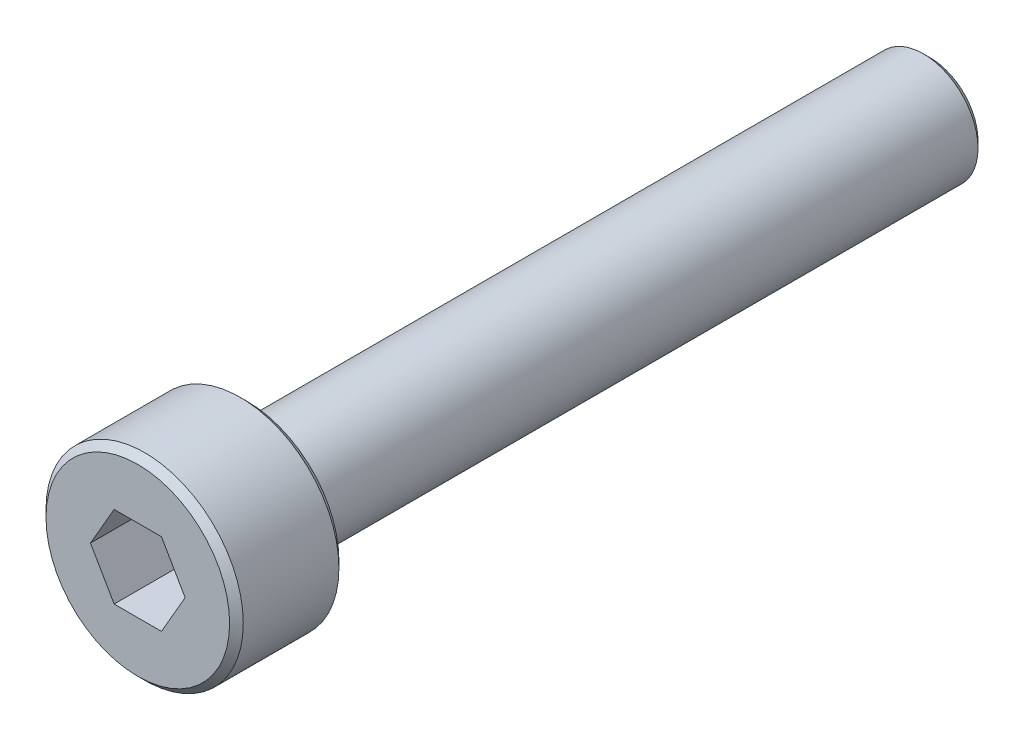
from build123d import *

# Parameters (mm, degrees)
SKETCH1_R           = 2
BOSS_EXTRUDE1_DEPTH = 25
SKETCH2_R           = 3.61
BOSS_EXTRUDE2_DEPTH = 4
CUT_EXTRUDE1_DEPTH  = 2.5
CHAMFER1_SIZE       = 0.25


with BuildPart() as part:
    # Sketch1 → Boss-Extrude1 (new body)
    with BuildSketch(Plane(origin=(0, 0, 0), x_dir=(0, 1, 0), z_dir=(0, 0, 1))):
        with Locations(Location((0, 0, 0), (0, 0, 270))):
            Circle(SKETCH1_R)
    extrude(amount=BOSS_EXTRUDE1_DEPTH)

    # Sketch2 → Boss-Extrude2 (add)
    with BuildSketch(Plane.XY.offset(25)):
        Circle(SKETCH2_R)
    extrude(amount=BOSS_EXTRUDE2_DEPTH)

    # Sketch3 → Cut-Extrude1 (cut)
    with BuildSketch(Plane.XY.offset(29)):
        Polygon((1.732050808, 0), (0.866025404, 1.5), (-0.866025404, 1.5), (-1.732050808, 0), (-0.866025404, -1.5), (0.866025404, -1.5), align=None)
    extrude(amount=-CUT_EXTRUDE1_DEPTH, mode=Mode.SUBTRACT)

    # Chamfer1
    chamfer1_edges = [part.edges().sort_by_distance(p)[0] for p in [
        (-2, 0, 0),
        (-3.61, 0, 25),
        (-3.61, 0, 29),
    ]]
    chamfer(chamfer1_edges, length=CHAMFER1_SIZE)


solid = part.part
